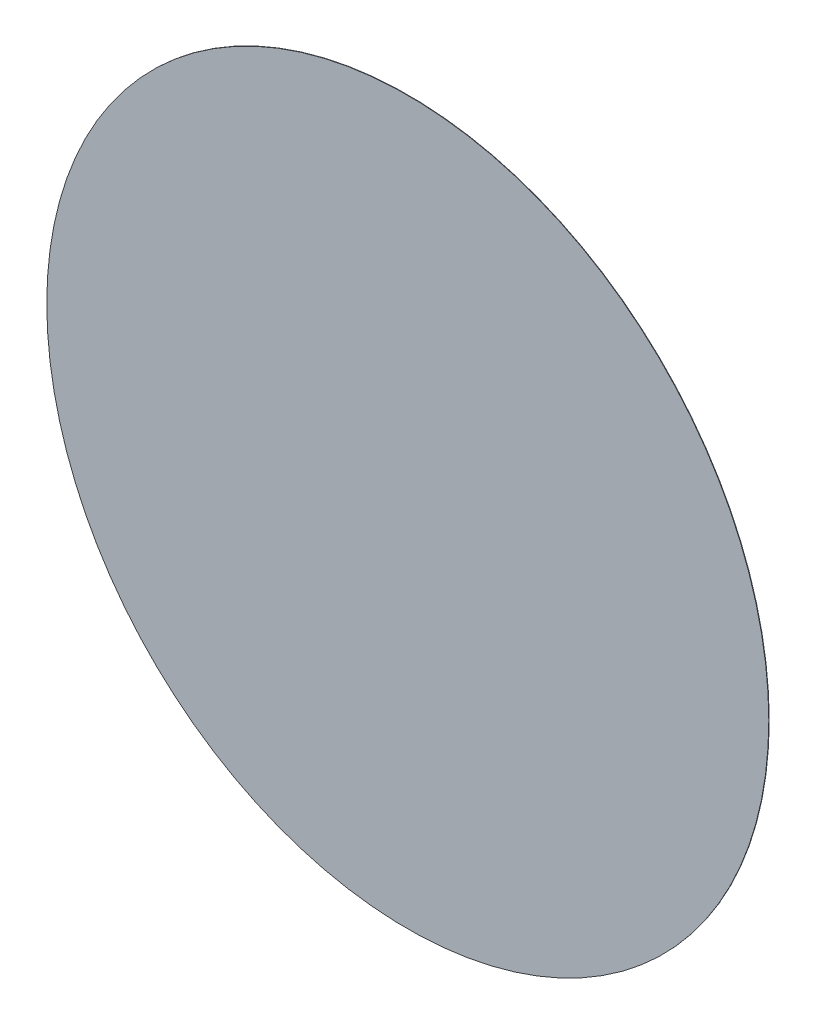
from build123d import *

# Parameters (mm, degrees)
SKETCH1_R      = 12.5
EXTRUDE1_DEPTH = 0.015


with BuildPart() as part:
    # Sketch1 → Extrude1 (new body)
    with BuildSketch(Plane.XY):
        Circle(SKETCH1_R)
    extrude(amount=EXTRUDE1_DEPTH)


solid = part.part
